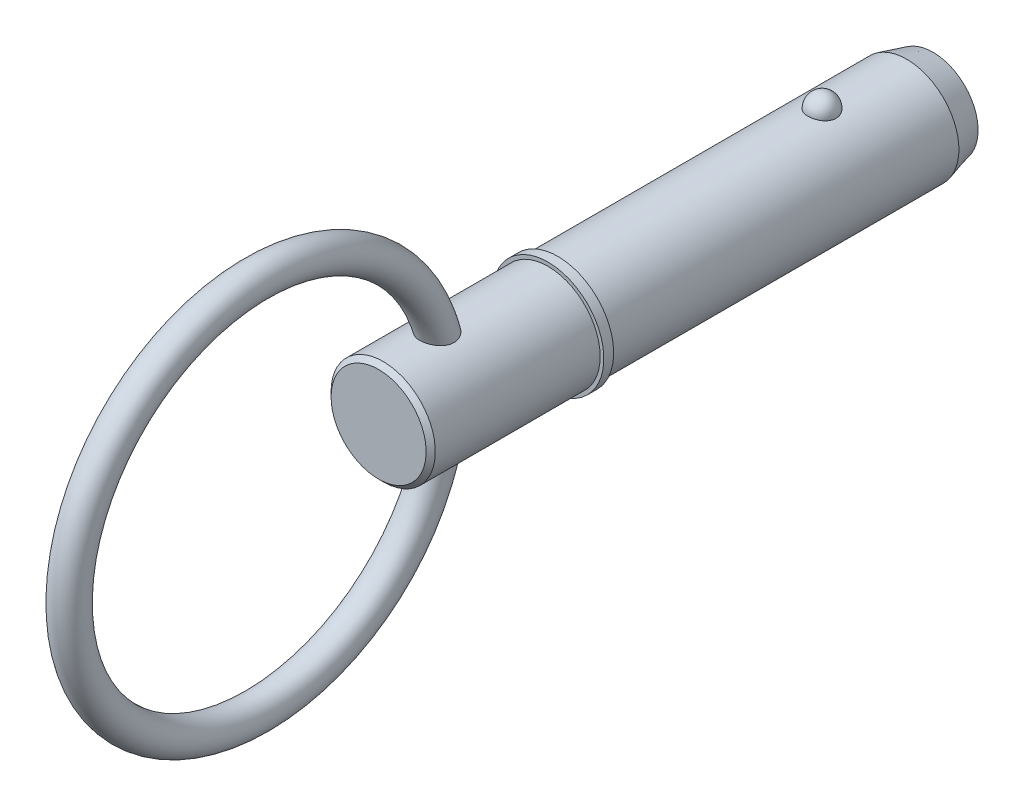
ISO-10303-21;
HEADER;
FILE_DESCRIPTION(('STEP AP214'),'2;1');
FILE_NAME('part.step','',(''),(''),'','','');
FILE_SCHEMA(('AUTOMOTIVE_DESIGN { 1 0 10303 214 1 1 1 1 }'));
ENDSEC;
DATA;
#1=APPLICATION_CONTEXT('core data for automotive mechanical design processes');
#2=APPLICATION_PROTOCOL_DEFINITION('international standard','automotive_design',2000,#1);
#3=PRODUCT_CONTEXT('',#1,'mechanical');
#4=PRODUCT('Part','Part','',(#3));
#5=PRODUCT_RELATED_PRODUCT_CATEGORY('part','',(#4));
#6=PRODUCT_DEFINITION_FORMATION('','',#4);
#7=PRODUCT_DEFINITION_CONTEXT('part definition',#1,'design');
#8=PRODUCT_DEFINITION('design','',#6,#7);
#9=PRODUCT_DEFINITION_SHAPE('','',#8);
#10=(LENGTH_UNIT() NAMED_UNIT(*) SI_UNIT(.MILLI.,.METRE.));
#11=(NAMED_UNIT(*) PLANE_ANGLE_UNIT() SI_UNIT($,.RADIAN.));
#12=(NAMED_UNIT(*) SI_UNIT($,.STERADIAN.) SOLID_ANGLE_UNIT());
#13=UNCERTAINTY_MEASURE_WITH_UNIT(LENGTH_MEASURE(1.E-05),#10,'distance_accuracy_value','');
#14=(GEOMETRIC_REPRESENTATION_CONTEXT(3) GLOBAL_UNCERTAINTY_ASSIGNED_CONTEXT((#13)) GLOBAL_UNIT_ASSIGNED_CONTEXT((#10,
#11,#12)) REPRESENTATION_CONTEXT('',''));
#15=CARTESIAN_POINT('',(0.,0.,0.));
#16=DIRECTION('',(0.,0.,1.));
#17=DIRECTION('',(1.,0.,0.));
#18=AXIS2_PLACEMENT_3D('',#15,#16,#17);
#19=CARTESIAN_POINT('',(0.,0.,38.1));
#20=DIRECTION('',(0.,0.,-1.));
#21=DIRECTION('',(-1.,0.,0.));
#22=AXIS2_PLACEMENT_3D('',#19,#20,#21);
#23=CYLINDRICAL_SURFACE('',#22,7.94);
#24=CARTESIAN_POINT('',(2.13020349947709,7.64891057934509,-2.15));
#25=CARTESIAN_POINT('',(2.1302012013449,7.64891247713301,-2.0297816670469));
#26=CARTESIAN_POINT('',(2.12037546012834,7.65166842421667,-1.90953383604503));
#27=CARTESIAN_POINT('',(2.08130792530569,7.66238579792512,-1.67243962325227));
#28=CARTESIAN_POINT('',(2.05205785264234,7.67034944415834,-1.55559471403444));
#29=CARTESIAN_POINT('',(1.97489181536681,7.69057749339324,-1.32869361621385));
#30=CARTESIAN_POINT('',(1.92698409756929,7.70283999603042,-1.21863445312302));
#31=CARTESIAN_POINT('',(1.81370645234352,7.73029430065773,-1.00831338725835));
#32=CARTESIAN_POINT('',(1.74833715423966,7.7454859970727,-0.908051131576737));
#33=CARTESIAN_POINT('',(1.60144242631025,7.77718699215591,-0.719628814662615));
#34=CARTESIAN_POINT('',(1.51984382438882,7.7937020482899,-0.631526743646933));
#35=CARTESIAN_POINT('',(1.34279837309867,7.82614685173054,-0.470411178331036));
#36=CARTESIAN_POINT('',(1.24735148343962,7.84207659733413,-0.397397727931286));
#37=CARTESIAN_POINT('',(1.04544839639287,7.87153116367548,-0.268681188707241));
#38=CARTESIAN_POINT('',(0.939022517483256,7.88506234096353,-0.212932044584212));
#39=CARTESIAN_POINT('',(0.717931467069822,7.90825597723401,-0.120080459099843));
#40=CARTESIAN_POINT('',(0.603267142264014,7.9179188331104,-0.0829761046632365));
#41=CARTESIAN_POINT('',(0.371015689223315,7.93216561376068,-0.0289596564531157));
#42=CARTESIAN_POINT('',(0.253510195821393,7.93683225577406,-0.0117183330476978));
#43=CARTESIAN_POINT('',(0.0171784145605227,7.94086051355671,0.00318921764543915));
#44=CARTESIAN_POINT('',(-0.101647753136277,7.94022260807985,0.000857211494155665));
#45=CARTESIAN_POINT('',(-0.335567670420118,7.93375751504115,-0.0231465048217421));
#46=CARTESIAN_POINT('',(-0.450690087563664,7.92799987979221,-0.0445590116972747));
#47=CARTESIAN_POINT('',(-0.675610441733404,7.91200792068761,-0.105760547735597));
#48=CARTESIAN_POINT('',(-0.785408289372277,7.90177352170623,-0.145549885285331));
#49=CARTESIAN_POINT('',(-0.997270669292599,7.87784802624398,-0.242675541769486));
#50=CARTESIAN_POINT('',(-1.0992893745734,7.86413823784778,-0.300107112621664));
#51=CARTESIAN_POINT('',(-1.29223659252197,7.83474718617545,-0.430887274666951));
#52=CARTESIAN_POINT('',(-1.38316404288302,7.81906573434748,-0.50423738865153));
#53=CARTESIAN_POINT('',(-1.55313516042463,7.78710451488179,-0.666358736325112));
#54=CARTESIAN_POINT('',(-1.63193689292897,7.77081906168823,-0.755382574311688));
#55=CARTESIAN_POINT('',(-1.77366356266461,7.73970270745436,-0.945507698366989));
#56=CARTESIAN_POINT('',(-1.83658745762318,7.72487190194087,-1.04660977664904));
#57=CARTESIAN_POINT('',(-1.94556640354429,7.6981535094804,-1.25927689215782));
#58=CARTESIAN_POINT('',(-1.99143480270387,7.6862989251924,-1.3709418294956));
#59=CARTESIAN_POINT('',(-2.06418311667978,7.66708387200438,-1.60066153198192));
#60=CARTESIAN_POINT('',(-2.0910635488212,7.65972328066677,-1.71871612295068));
#61=CARTESIAN_POINT('',(-2.12508507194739,7.65035479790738,-1.9573607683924));
#62=CARTESIAN_POINT('',(-2.13230490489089,7.64832555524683,-2.0779387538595));
#63=CARTESIAN_POINT('',(-2.12704767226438,7.64978921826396,-2.31862835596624));
#64=CARTESIAN_POINT('',(-2.1145710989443,7.6532819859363,-2.43873998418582));
#65=CARTESIAN_POINT('',(-2.07034166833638,7.66536368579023,-2.67451689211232));
#66=CARTESIAN_POINT('',(-2.03867758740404,7.67392914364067,-2.79020005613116));
#67=CARTESIAN_POINT('',(-1.95694065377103,7.69517736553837,-3.01446692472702));
#68=CARTESIAN_POINT('',(-1.90686710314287,7.70786028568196,-3.12305035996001));
#69=CARTESIAN_POINT('',(-1.78925555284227,7.73600831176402,-3.33065971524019));
#70=CARTESIAN_POINT('',(-1.72162904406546,7.75148739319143,-3.4296336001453));
#71=CARTESIAN_POINT('',(-1.57074739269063,7.78346215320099,-3.61466914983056));
#72=CARTESIAN_POINT('',(-1.48749169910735,7.79995786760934,-3.70073035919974));
#73=CARTESIAN_POINT('',(-1.30720250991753,7.83219119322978,-3.85783594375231));
#74=CARTESIAN_POINT('',(-1.2101234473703,7.84792605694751,-3.92882863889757));
#75=CARTESIAN_POINT('',(-1.00503150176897,7.87681523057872,-4.05342383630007));
#76=CARTESIAN_POINT('',(-0.897019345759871,7.88996971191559,-4.10702749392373));
#77=CARTESIAN_POINT('',(-0.674439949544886,7.91208451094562,-4.19477736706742));
#78=CARTESIAN_POINT('',(-0.559965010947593,7.92109245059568,-4.22914554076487));
#79=CARTESIAN_POINT('',(-0.326625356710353,7.93413878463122,-4.27838865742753));
#80=CARTESIAN_POINT('',(-0.207761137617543,7.93817773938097,-4.29326579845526));
#81=CARTESIAN_POINT('',(0.0287357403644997,7.94081322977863,-4.3030062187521));
#82=CARTESIAN_POINT('',(0.146353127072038,7.93950453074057,-4.29821797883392));
#83=CARTESIAN_POINT('',(0.379062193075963,7.93180098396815,-4.26955229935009));
#84=CARTESIAN_POINT('',(0.494153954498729,7.92540630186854,-4.24567548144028));
#85=CARTESIAN_POINT('',(0.718185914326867,7.90824874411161,-4.17962260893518));
#86=CARTESIAN_POINT('',(0.827145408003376,7.89750055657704,-4.13750805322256));
#87=CARTESIAN_POINT('',(1.03638036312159,7.87277755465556,-4.03615078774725));
#88=CARTESIAN_POINT('',(1.13665531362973,7.85880255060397,-3.97690707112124));
#89=CARTESIAN_POINT('',(1.32729731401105,7.82887859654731,-3.84189297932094));
#90=CARTESIAN_POINT('',(1.41749828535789,7.81290379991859,-3.76589388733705));
#91=CARTESIAN_POINT('',(1.58397257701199,7.78086330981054,-3.59992466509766));
#92=CARTESIAN_POINT('',(1.66024342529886,7.76479760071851,-3.50995206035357));
#93=CARTESIAN_POINT('',(1.79805631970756,7.73405928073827,-3.31688321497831));
#94=CARTESIAN_POINT('',(1.85933944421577,7.719413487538,-3.213597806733));
#95=CARTESIAN_POINT('',(1.96397499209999,7.69345992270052,-2.99796163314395));
#96=CARTESIAN_POINT('',(2.00733488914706,7.68215076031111,-2.88561466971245));
#97=CARTESIAN_POINT('',(2.07068045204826,7.66529896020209,-2.66994136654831));
#98=CARTESIAN_POINT('',(2.09296296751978,7.65919990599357,-2.56732606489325));
#99=CARTESIAN_POINT('',(2.12272535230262,7.65100492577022,-2.35981463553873));
#100=CARTESIAN_POINT('',(2.13020550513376,7.64890892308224,-2.25491855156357));
#101=CARTESIAN_POINT('',(2.13020349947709,7.64891057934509,-2.15));
#102=B_SPLINE_CURVE_WITH_KNOTS('',3,(#24,#25,#26,#27,#28,#29,#30,#31,#32,#33,#34,#35,#36,#37,
#38,#39,#40,#41,#42,#43,#44,#45,#46,#47,#48,#49,#50,#51,#52,#53,#54,#55,#56,#57,#58,#59,#60,#61,
#62,#63,#64,#65,#66,#67,#68,#69,#70,#71,#72,#73,#74,#75,#76,#77,#78,#79,#80,#81,#82,#83,#84,#85,
#86,#87,#88,#89,#90,#91,#92,#93,#94,#95,#96,#97,#98,#99,#100,#101),.UNSPECIFIED.,.T.,.F.,(4,2,2,
2,2,2,2,2,2,2,2,2,2,2,2,2,2,2,2,2,2,2,2,2,2,2,2,2,2,2,2,2,2,2,2,2,2,2,4),(0.,0.360277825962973,
0.720709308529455,1.0809816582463,1.44124102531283,1.80316307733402,2.16508618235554,
2.52603531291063,2.88694740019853,3.24178717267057,3.59659491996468,3.94665496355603,
4.2967208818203,4.64871108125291,5.00073496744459,5.35906196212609,5.71741247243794,
6.079576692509,6.44173104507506,6.80243279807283,7.16312553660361,7.52216203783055,
7.88121215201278,8.24210915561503,8.60301888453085,8.96514709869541,9.32725124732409,
9.68508606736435,10.0428805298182,10.3943622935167,10.7458326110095,11.0961268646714,
11.4464417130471,11.8018724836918,12.1573662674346,12.5186252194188,12.8797333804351,
13.1941658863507,13.5085923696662),.UNSPECIFIED.);
#103=CARTESIAN_POINT('',(2.13020349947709,7.64891057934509,-2.15));
#104=VERTEX_POINT('',#103);
#105=EDGE_CURVE('E101',#104,#104,#102,.T.);
#106=ORIENTED_EDGE('',*,*,#105,.T.);
#107=EDGE_LOOP('',(#106));
#108=FACE_BOUND('',#107,.T.);
#109=CARTESIAN_POINT('',(0.,0.,-15.05));
#110=DIRECTION('',(0.,0.,-1.));
#111=DIRECTION('',(-1.,0.,0.));
#112=AXIS2_PLACEMENT_3D('',#109,#110,#111);
#113=CIRCLE('',#112,7.94);
#114=CARTESIAN_POINT('',(-7.94,0.,-15.05));
#115=VERTEX_POINT('',#114);
#116=EDGE_CURVE('E109',#115,#115,#113,.F.);
#117=ORIENTED_EDGE('',*,*,#116,.T.);
#118=EDGE_LOOP('',(#117));
#119=FACE_BOUND('',#118,.T.);
#120=CARTESIAN_POINT('',(0.,0.,38.1));
#121=DIRECTION('',(0.,0.,1.));
#122=DIRECTION('',(1.,0.,0.));
#123=AXIS2_PLACEMENT_3D('',#120,#121,#122);
#124=CIRCLE('',#123,7.94);
#125=CARTESIAN_POINT('',(7.94,0.,38.1));
#126=VERTEX_POINT('',#125);
#127=EDGE_CURVE('E107',#126,#126,#124,.T.);
#128=ORIENTED_EDGE('',*,*,#127,.F.);
#129=EDGE_LOOP('',(#128));
#130=FACE_BOUND('',#129,.T.);
#131=ADVANCED_FACE('F39',(#108,#119,#130),#23,.T.);
#132=CARTESIAN_POINT('',(0.,0.,-19.05));
#133=DIRECTION('',(0.,0.,-1.));
#134=DIRECTION('',(-1.,0.,0.));
#135=AXIS2_PLACEMENT_3D('',#132,#133,#134);
#136=PLANE('',#135);
#137=CARTESIAN_POINT('',(0.,0.,-19.05));
#138=DIRECTION('',(0.,0.,-1.));
#139=DIRECTION('',(-1.,0.,0.));
#140=AXIS2_PLACEMENT_3D('',#137,#138,#139);
#141=CIRCLE('',#140,6.86820323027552);
#142=CARTESIAN_POINT('',(-6.86820323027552,0.,-19.05));
#143=VERTEX_POINT('',#142);
#144=EDGE_CURVE('E141',#143,#143,#141,.T.);
#145=ORIENTED_EDGE('',*,*,#144,.T.);
#146=EDGE_LOOP('',(#145));
#147=FACE_BOUND('',#146,.T.);
#148=ADVANCED_FACE('F87',(#147),#136,.T.);
#149=CARTESIAN_POINT('',(0.,0.,-19.05));
#150=DIRECTION('',(0.,0.,1.));
#151=DIRECTION('',(1.,0.,0.));
#152=AXIS2_PLACEMENT_3D('',#149,#150,#151);
#153=CONICAL_SURFACE('',#152,6.86820323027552,0.261799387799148);
#154=ORIENTED_EDGE('',*,*,#116,.F.);
#155=EDGE_LOOP('',(#154));
#156=FACE_BOUND('',#155,.T.);
#157=ORIENTED_EDGE('',*,*,#144,.F.);
#158=EDGE_LOOP('',(#157));
#159=FACE_BOUND('',#158,.T.);
#160=ADVANCED_FACE('F93',(#156,#159),#153,.T.);
#161=CARTESIAN_POINT('',(0.,7.94,-2.15));
#162=DIRECTION('',(0.,1.,0.));
#163=DIRECTION('',(0.,0.,1.));
#164=AXIS2_PLACEMENT_3D('',#161,#162,#163);
#165=SPHERICAL_SURFACE('',#164,2.15);
#166=ORIENTED_EDGE('',*,*,#105,.F.);
#167=EDGE_LOOP('',(#166));
#168=FACE_BOUND('',#167,.T.);
#169=ADVANCED_FACE('F112',(#168),#165,.T.);
#170=CARTESIAN_POINT('',(0.,0.,38.1));
#171=DIRECTION('',(0.,0.,-1.));
#172=DIRECTION('',(-1.,0.,0.));
#173=AXIS2_PLACEMENT_3D('',#170,#171,#172);
#174=PLANE('',#173);
#175=ORIENTED_EDGE('',*,*,#127,.T.);
#176=EDGE_LOOP('',(#175));
#177=FACE_BOUND('',#176,.T.);
#178=CARTESIAN_POINT('',(0.,0.,38.1));
#179=DIRECTION('',(0.,0.,-1.));
#180=DIRECTION('',(-1.,0.,0.));
#181=AXIS2_PLACEMENT_3D('',#178,#179,#180);
#182=CIRCLE('',#181,8.5);
#183=CARTESIAN_POINT('',(-8.5,0.,38.1));
#184=VERTEX_POINT('',#183);
#185=EDGE_CURVE('E108',#184,#184,#182,.T.);
#186=ORIENTED_EDGE('',*,*,#185,.T.);
#187=EDGE_LOOP('',(#186));
#188=FACE_BOUND('',#187,.T.);
#189=ADVANCED_FACE('F116',(#177,#188),#174,.T.);
#190=CARTESIAN_POINT('',(0.,0.,33.7287874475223));
#191=DIRECTION('',(0.,0.,-1.));
#192=DIRECTION('',(-1.,0.,0.));
#193=AXIS2_PLACEMENT_3D('',#190,#191,#192);
#194=CYLINDRICAL_SURFACE('',#193,8.5);
#195=CARTESIAN_POINT('',(0.,0.,39.6));
#196=DIRECTION('',(0.,0.,-1.));
#197=DIRECTION('',(-1.,0.,0.));
#198=AXIS2_PLACEMENT_3D('',#195,#196,#197);
#199=CIRCLE('',#198,8.5);
#200=CARTESIAN_POINT('',(-8.5,0.,39.6));
#201=VERTEX_POINT('',#200);
#202=EDGE_CURVE('E133',#201,#201,#199,.T.);
#203=ORIENTED_EDGE('',*,*,#202,.T.);
#204=EDGE_LOOP('',(#203));
#205=FACE_BOUND('',#204,.T.);
#206=ORIENTED_EDGE('',*,*,#185,.F.);
#207=EDGE_LOOP('',(#206));
#208=FACE_BOUND('',#207,.T.);
#209=ADVANCED_FACE('F120',(#205,#208),#194,.T.);
#210=CARTESIAN_POINT('',(0.,8.5,39.6));
#211=DIRECTION('',(0.,0.,1.));
#212=DIRECTION('',(1.,0.,0.));
#213=AXIS2_PLACEMENT_3D('',#210,#211,#212);
#214=PLANE('',#213);
#215=CARTESIAN_POINT('',(0.,0.,39.6));
#216=DIRECTION('',(0.,0.,1.));
#217=DIRECTION('',(1.,0.,0.));
#218=AXIS2_PLACEMENT_3D('',#215,#216,#217);
#219=CIRCLE('',#218,7.94);
#220=CARTESIAN_POINT('',(7.94,0.,39.6));
#221=VERTEX_POINT('',#220);
#222=EDGE_CURVE('E111',#221,#221,#219,.T.);
#223=ORIENTED_EDGE('',*,*,#222,.F.);
#224=EDGE_LOOP('',(#223));
#225=FACE_BOUND('',#224,.T.);
#226=ORIENTED_EDGE('',*,*,#202,.F.);
#227=EDGE_LOOP('',(#226));
#228=FACE_BOUND('',#227,.T.);
#229=ADVANCED_FACE('F84',(#225,#228),#214,.T.);
#230=CARTESIAN_POINT('',(0.,0.,65.41));
#231=DIRECTION('',(0.,0.,-1.));
#232=DIRECTION('',(-1.,0.,0.));
#233=AXIS2_PLACEMENT_3D('',#230,#231,#232);
#234=CYLINDRICAL_SURFACE('',#233,7.94);
#235=CARTESIAN_POINT('',(-1.15544091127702,-7.85547938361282,54.211910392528));
#236=CARTESIAN_POINT('',(-1.03089695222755,-7.87379554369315,54.1496153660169));
#237=CARTESIAN_POINT('',(-0.900845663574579,-7.8898743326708,54.0975936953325));
#238=CARTESIAN_POINT('',(-0.633417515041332,-7.91583465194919,54.015265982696));
#239=CARTESIAN_POINT('',(-0.49603783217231,-7.92571377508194,53.9849683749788));
#240=CARTESIAN_POINT('',(-0.217881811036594,-7.93823020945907,53.9467734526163));
#241=CARTESIAN_POINT('',(-0.0771057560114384,-7.94086812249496,53.9388742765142));
#242=CARTESIAN_POINT('',(0.20382834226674,-7.93862624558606,53.9456489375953));
#243=CARTESIAN_POINT('',(0.343986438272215,-7.93374711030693,53.9603208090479));
#244=CARTESIAN_POINT('',(0.61954486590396,-7.9169944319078,54.0118776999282));
#245=CARTESIAN_POINT('',(0.754950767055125,-7.9051293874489,54.048735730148));
#246=CARTESIAN_POINT('',(1.01737529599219,-7.8756583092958,54.1438425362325));
#247=CARTESIAN_POINT('',(1.14439334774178,-7.85805188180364,54.2020927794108));
#248=CARTESIAN_POINT('',(1.38668443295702,-7.81893907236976,54.3388428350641));
#249=CARTESIAN_POINT('',(1.50193494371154,-7.79742542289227,54.4173804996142));
#250=CARTESIAN_POINT('',(1.71711272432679,-7.75288428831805,54.5928724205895));
#251=CARTESIAN_POINT('',(1.81704089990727,-7.72985689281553,54.6898255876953));
#252=CARTESIAN_POINT('',(1.99787261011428,-7.68509802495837,54.8988714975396));
#253=CARTESIAN_POINT('',(2.07893183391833,-7.66335713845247,55.0108273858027));
#254=CARTESIAN_POINT('',(2.22076589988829,-7.62346723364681,55.2474809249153));
#255=CARTESIAN_POINT('',(2.28154607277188,-7.6053172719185,55.3721752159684));
#256=CARTESIAN_POINT('',(2.38011540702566,-7.57504217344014,55.6276189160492));
#257=CARTESIAN_POINT('',(2.41840843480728,-7.56278621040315,55.7581588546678));
#258=CARTESIAN_POINT('',(2.47363993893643,-7.54490265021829,56.0240951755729));
#259=CARTESIAN_POINT('',(2.49057788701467,-7.53927521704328,56.1594916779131));
#260=CARTESIAN_POINT('',(2.50351014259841,-7.53499042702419,56.4324287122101));
#261=CARTESIAN_POINT('',(2.49933630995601,-7.53638902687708,56.5699777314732));
#262=CARTESIAN_POINT('',(2.47072547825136,-7.54581524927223,56.8426982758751));
#263=CARTESIAN_POINT('',(2.44628184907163,-7.55384504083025,56.9778690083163));
#264=CARTESIAN_POINT('',(2.3758931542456,-7.57629160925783,57.2530857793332));
#265=CARTESIAN_POINT('',(2.32844094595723,-7.5911515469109,57.3927089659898));
#266=CARTESIAN_POINT('',(2.21332780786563,-7.62550828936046,57.6627818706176));
#267=CARTESIAN_POINT('',(2.14565489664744,-7.64500784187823,57.7932260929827));
#268=CARTESIAN_POINT('',(1.98438755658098,-7.68852412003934,58.0537020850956));
#269=CARTESIAN_POINT('',(1.88896913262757,-7.71279219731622,58.1825698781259));
#270=CARTESIAN_POINT('',(1.67743245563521,-7.76154719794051,58.422112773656));
#271=CARTESIAN_POINT('',(1.56130644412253,-7.78603420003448,58.5327810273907));
#272=CARTESIAN_POINT('',(1.31168281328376,-7.83191501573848,58.7301000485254));
#273=CARTESIAN_POINT('',(1.17841631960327,-7.85334315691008,58.8170293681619));
#274=CARTESIAN_POINT('',(0.967442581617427,-7.88116219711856,58.9266577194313));
#275=CARTESIAN_POINT('',(0.8952834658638,-7.88971376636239,58.9597363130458));
#276=CARTESIAN_POINT('',(0.747777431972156,-7.90505596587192,59.0184005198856));
#277=CARTESIAN_POINT('',(0.672431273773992,-7.91184701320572,59.0439879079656));
#278=CARTESIAN_POINT('',(0.530575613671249,-7.92252382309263,59.0839121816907));
#279=CARTESIAN_POINT('',(0.464394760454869,-7.92668987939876,59.099349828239));
#280=CARTESIAN_POINT('',(0.330815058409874,-7.9333870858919,59.1240698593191));
#281=CARTESIAN_POINT('',(0.263416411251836,-7.93591850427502,59.1333532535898));
#282=CARTESIAN_POINT('',(0.128041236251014,-7.93925585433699,59.1455779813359));
#283=CARTESIAN_POINT('',(0.0600650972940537,-7.94006286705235,59.1485232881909));
#284=CARTESIAN_POINT('',(-0.0758408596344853,-7.93992929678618,59.1480336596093));
#285=CARTESIAN_POINT('',(-0.143770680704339,-7.93898884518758,59.1445992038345));
#286=CARTESIAN_POINT('',(-0.330023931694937,-7.93402174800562,59.1264060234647));
#287=CARTESIAN_POINT('',(-0.447720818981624,-7.92820264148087,59.1050608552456));
#288=CARTESIAN_POINT('',(-0.677833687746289,-7.91185818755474,59.0440930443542));
#289=CARTESIAN_POINT('',(-0.790248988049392,-7.90133223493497,59.0044680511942));
#290=CARTESIAN_POINT('',(-1.01082100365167,-7.8762011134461,58.9074365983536));
#291=CARTESIAN_POINT('',(-1.11873674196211,-7.86147932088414,58.849515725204));
#292=CARTESIAN_POINT('',(-1.32464461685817,-7.8294189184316,58.7187556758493));
#293=CARTESIAN_POINT('',(-1.42263264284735,-7.81207923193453,58.6459103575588));
#294=CARTESIAN_POINT('',(-1.62038324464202,-7.77363945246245,58.4765366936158));
#295=CARTESIAN_POINT('',(-1.71849387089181,-7.75235190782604,58.3781231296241));
#296=CARTESIAN_POINT('',(-1.89908721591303,-7.71010284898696,58.1677830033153));
#297=CARTESIAN_POINT('',(-1.98155871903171,-7.68914157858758,58.0558468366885));
#298=CARTESIAN_POINT('',(-2.13974270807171,-7.64674394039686,57.8051085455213));
#299=CARTESIAN_POINT('',(-2.2130402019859,-7.62562536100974,57.6647194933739));
#300=CARTESIAN_POINT('',(-2.33615659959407,-7.58881542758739,57.3732666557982));
#301=CARTESIAN_POINT('',(-2.38596943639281,-7.57312547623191,57.2222001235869));
#302=CARTESIAN_POINT('',(-2.46059473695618,-7.54921618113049,56.9104922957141));
#303=CARTESIAN_POINT('',(-2.48494918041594,-7.54113395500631,56.7497288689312));
#304=CARTESIAN_POINT('',(-2.50480773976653,-7.53456588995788,56.4262447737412));
#305=CARTESIAN_POINT('',(-2.50033692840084,-7.53607171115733,56.2635259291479));
#306=CARTESIAN_POINT('',(-2.46306926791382,-7.54832452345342,55.9571659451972));
#307=CARTESIAN_POINT('',(-2.4329569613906,-7.55819528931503,55.8131623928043));
#308=CARTESIAN_POINT('',(-2.34806892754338,-7.58499431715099,55.5333040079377));
#309=CARTESIAN_POINT('',(-2.29330013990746,-7.60192059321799,55.3974468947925));
#310=CARTESIAN_POINT('',(-2.16523724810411,-7.63933506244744,55.1476573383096));
#311=CARTESIAN_POINT('',(-2.09353456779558,-7.65948502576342,55.0328530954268));
#312=CARTESIAN_POINT('',(-1.93200913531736,-7.7018104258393,54.8172680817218));
#313=CARTESIAN_POINT('',(-1.842192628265,-7.72398516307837,54.7164824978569));
#314=CARTESIAN_POINT('',(-1.65746337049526,-7.76558957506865,54.5413148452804));
#315=CARTESIAN_POINT('',(-1.56413624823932,-7.78505810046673,54.4652591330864));
#316=CARTESIAN_POINT('',(-1.36706423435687,-7.82207051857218,54.3275357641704));
#317=CARTESIAN_POINT('',(-1.26331856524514,-7.83961426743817,54.2658691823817));
#318=CARTESIAN_POINT('',(-1.15544091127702,-7.85547938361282,54.211910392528));
#319=B_SPLINE_CURVE_WITH_KNOTS('',3,(#235,#236,#237,#238,#239,#240,#241,#242,#243,#244,#245,
#246,#247,#248,#249,#250,#251,#252,#253,#254,#255,#256,#257,#258,#259,#260,#261,#262,#263,#264,
#265,#266,#267,#268,#269,#270,#271,#272,#273,#274,#275,#276,#277,#278,#279,#280,#281,#282,#283,
#284,#285,#286,#287,#288,#289,#290,#291,#292,#293,#294,#295,#296,#297,#298,#299,#300,#301,#302,
#303,#304,#305,#306,#307,#308,#309,#310,#311,#312,#313,#314,#315,#316,#317,#318),.UNSPECIFIED.,
.T.,.F.,(4,2,2,2,2,2,2,2,2,2,2,2,2,2,2,2,2,2,2,2,2,2,2,2,2,2,2,2,2,2,2,2,2,2,2,2,2,2,2,2,2,4),
(0.,0.420927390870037,0.84201811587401,1.26307384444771,1.68409290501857,2.10460083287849,
2.52513760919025,2.94646475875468,3.36776699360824,3.78545897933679,4.20304108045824,
4.61086922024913,5.0187074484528,5.42979890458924,5.84102487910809,6.2838331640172,
6.72690434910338,7.21113455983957,7.69554657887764,8.1740030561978,8.41316278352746,
8.65226580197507,8.85622998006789,9.0601606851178,9.2639635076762,9.46775100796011,
9.82521046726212,10.1827159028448,10.5513335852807,10.9201032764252,11.3402098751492,
11.7606166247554,12.2377707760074,12.715048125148,13.2007716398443,13.6860727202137,
14.1260485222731,14.5659005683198,14.9745225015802,15.3830037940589,15.7475760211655,
16.1121754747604),.UNSPECIFIED.);
#320=CARTESIAN_POINT('',(-1.15544091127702,-7.85547938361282,54.211910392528));
#321=VERTEX_POINT('',#320);
#322=EDGE_CURVE('E10',#321,#321,#319,.T.);
#323=ORIENTED_EDGE('',*,*,#322,.F.);
#324=EDGE_LOOP('',(#323));
#325=FACE_BOUND('',#324,.T.);
#326=CARTESIAN_POINT('',(-1.15544091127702,7.85547938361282,54.211910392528));
#327=CARTESIAN_POINT('',(-1.278579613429,7.83736699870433,54.2735072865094));
#328=CARTESIAN_POINT('',(-1.39638360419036,7.8170599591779,54.3451720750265));
#329=CARTESIAN_POINT('',(-1.61803025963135,7.77421032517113,54.5070825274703));
#330=CARTESIAN_POINT('',(-1.72186951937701,7.75166718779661,54.5973327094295));
#331=CARTESIAN_POINT('',(-1.91269683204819,7.70680387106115,54.7943958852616));
#332=CARTESIAN_POINT('',(-1.99967065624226,7.68448389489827,54.9012227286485));
#333=CARTESIAN_POINT('',(-2.15412555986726,7.64262858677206,55.1286078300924));
#334=CARTESIAN_POINT('',(-2.2216118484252,7.62309251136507,55.2491624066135));
#335=CARTESIAN_POINT('',(-2.3342927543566,7.5893410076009,55.498377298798));
#336=CARTESIAN_POINT('',(-2.37985628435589,7.57503857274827,55.6268591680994));
#337=CARTESIAN_POINT('',(-2.44955571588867,7.55278941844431,55.890011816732));
#338=CARTESIAN_POINT('',(-2.47369226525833,7.544842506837,56.0246824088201));
#339=CARTESIAN_POINT('',(-2.50059611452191,7.53596831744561,56.2961377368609));
#340=CARTESIAN_POINT('',(-2.50339277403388,7.53503139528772,56.4329193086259));
#341=CARTESIAN_POINT('',(-2.48855779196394,7.53994222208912,56.7052240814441));
#342=CARTESIAN_POINT('',(-2.47092012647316,7.54579197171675,56.8407468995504));
#343=CARTESIAN_POINT('',(-2.41469361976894,7.56397908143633,57.1162931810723));
#344=CARTESIAN_POINT('',(-2.37479606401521,7.57671999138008,57.2560213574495));
#345=CARTESIAN_POINT('',(-2.27489955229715,7.60730881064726,57.5275158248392));
#346=CARTESIAN_POINT('',(-2.21489004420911,7.6251594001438,57.6592778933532));
#347=CARTESIAN_POINT('',(-2.06943931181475,7.66598084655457,57.9245250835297));
#348=CARTESIAN_POINT('',(-1.98208275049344,7.68928197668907,58.0569147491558));
#349=CARTESIAN_POINT('',(-1.78658869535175,7.73704343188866,58.3052357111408));
#350=CARTESIAN_POINT('',(-1.67843905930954,7.76150442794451,58.421157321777));
#351=CARTESIAN_POINT('',(-1.44142605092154,7.80900750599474,58.6336999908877));
#352=CARTESIAN_POINT('',(-1.31231821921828,7.83202775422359,58.7300586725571));
#353=CARTESIAN_POINT('',(-1.10627655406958,7.86286215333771,58.8546145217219));
#354=CARTESIAN_POINT('',(-1.035525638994,7.87252500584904,58.8928053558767));
#355=CARTESIAN_POINT('',(-0.890375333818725,7.89025728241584,58.9618851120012));
#356=CARTESIAN_POINT('',(-0.815978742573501,7.89832790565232,58.9927795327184));
#357=CARTESIAN_POINT('',(-0.674180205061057,7.91160332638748,59.0430828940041));
#358=CARTESIAN_POINT('',(-0.607145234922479,7.91704543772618,59.063468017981));
#359=CARTESIAN_POINT('',(-0.471385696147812,7.92628663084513,59.0978763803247));
#360=CARTESIAN_POINT('',(-0.402662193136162,7.93008672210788,59.1119035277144));
#361=CARTESIAN_POINT('',(-0.264153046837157,7.9359070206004,59.133322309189));
#362=CARTESIAN_POINT('',(-0.194368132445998,7.9379283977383,59.1407183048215));
#363=CARTESIAN_POINT('',(-0.0544054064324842,7.940122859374,59.1487430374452));
#364=CARTESIAN_POINT('',(0.0157723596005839,7.94029615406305,59.1493725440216));
#365=CARTESIAN_POINT('',(0.20629582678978,7.93822912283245,59.1418250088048));
#366=CARTESIAN_POINT('',(0.326425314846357,7.93416340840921,59.1269891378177));
#367=CARTESIAN_POINT('',(0.562310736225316,7.92094769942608,59.0780777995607));
#368=CARTESIAN_POINT('',(0.678066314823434,7.91179729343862,59.04400077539));
#369=CARTESIAN_POINT('',(0.903029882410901,7.88929555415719,58.9582699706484));
#370=CARTESIAN_POINT('',(1.01220356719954,7.87592415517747,58.9065321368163));
#371=CARTESIAN_POINT('',(1.22142047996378,7.84620431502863,58.7877939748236));
#372=CARTESIAN_POINT('',(1.32146048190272,7.82985482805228,58.7207882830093));
#373=CARTESIAN_POINT('',(1.52328754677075,7.7932678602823,58.5643092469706));
#374=CARTESIAN_POINT('',(1.6236508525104,7.77280069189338,58.4730560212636));
#375=CARTESIAN_POINT('',(1.80985117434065,7.73156849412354,58.2768153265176));
#376=CARTESIAN_POINT('',(1.895678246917,7.71080327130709,58.1718185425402));
#377=CARTESIAN_POINT('',(2.06302404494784,7.66785771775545,57.9345434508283));
#378=CARTESIAN_POINT('',(2.14213178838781,7.64590590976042,57.8005149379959));
#379=CARTESIAN_POINT('',(2.27825755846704,7.60645646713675,57.5209949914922));
#380=CARTESIAN_POINT('',(2.33526577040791,7.58896081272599,57.3754984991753));
#381=CARTESIAN_POINT('',(2.42707573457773,7.56011538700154,57.0702423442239));
#382=CARTESIAN_POINT('',(2.4608459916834,7.54905411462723,56.9101404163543));
#383=CARTESIAN_POINT('',(2.49980168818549,7.53624914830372,56.5861292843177));
#384=CARTESIAN_POINT('',(2.50500938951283,7.5344981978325,56.4222231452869));
#385=CARTESIAN_POINT('',(2.48594104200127,7.54080673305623,56.1099762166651));
#386=CARTESIAN_POINT('',(2.46407777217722,7.54806351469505,55.9614732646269));
#387=CARTESIAN_POINT('',(2.3945479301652,7.57040718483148,55.671258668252));
#388=CARTESIAN_POINT('',(2.34689355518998,7.58549037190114,55.5295438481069));
#389=CARTESIAN_POINT('',(2.2318274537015,7.62009243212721,55.2691410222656));
#390=CARTESIAN_POINT('',(2.16637710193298,7.63914093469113,55.1495179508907));
#391=CARTESIAN_POINT('',(2.01638736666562,7.68009146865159,54.9234609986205));
#392=CARTESIAN_POINT('',(1.93184850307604,7.7019934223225,54.8170267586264));
#393=CARTESIAN_POINT('',(1.746642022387,7.74608439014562,54.6206697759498));
#394=CARTESIAN_POINT('',(1.646079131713,7.76827073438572,54.5306474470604));
#395=CARTESIAN_POINT('',(1.43119791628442,7.81071401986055,54.3683086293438));
#396=CARTESIAN_POINT('',(1.31687846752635,7.83097080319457,54.2959935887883));
#397=CARTESIAN_POINT('',(1.07477437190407,7.86789551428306,54.169149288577));
#398=CARTESIAN_POINT('',(0.946739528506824,7.88446964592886,54.1150698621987));
#399=CARTESIAN_POINT('',(0.683029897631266,7.91167708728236,54.0282136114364));
#400=CARTESIAN_POINT('',(0.547354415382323,7.92230985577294,53.9954387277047));
#401=CARTESIAN_POINT('',(0.271066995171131,7.93658630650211,53.9517309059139));
#402=CARTESIAN_POINT('',(0.130424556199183,7.94017418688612,53.9409723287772));
#403=CARTESIAN_POINT('',(-0.150736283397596,7.93981282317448,53.9420624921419));
#404=CARTESIAN_POINT('',(-0.291254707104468,7.93586558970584,53.953905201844));
#405=CARTESIAN_POINT('',(-0.556023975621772,7.92151946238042,53.9978917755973));
#406=CARTESIAN_POINT('',(-0.680621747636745,7.91171585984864,54.0281668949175));
#407=CARTESIAN_POINT('',(-0.923476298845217,7.88705844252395,54.1067364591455));
#408=CARTESIAN_POINT('',(-1.04173303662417,7.87220459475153,54.1550310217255));
#409=CARTESIAN_POINT('',(-1.15544091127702,7.85547938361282,54.211910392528));
#410=B_SPLINE_CURVE_WITH_KNOTS('',3,(#326,#327,#328,#329,#330,#331,#332,#333,#334,#335,#336,
#337,#338,#339,#340,#341,#342,#343,#344,#345,#346,#347,#348,#349,#350,#351,#352,#353,#354,#355,
#356,#357,#358,#359,#360,#361,#362,#363,#364,#365,#366,#367,#368,#369,#370,#371,#372,#373,#374,
#375,#376,#377,#378,#379,#380,#381,#382,#383,#384,#385,#386,#387,#388,#389,#390,#391,#392,#393,
#394,#395,#396,#397,#398,#399,#400,#401,#402,#403,#404,#405,#406,#407,#408,#409),.UNSPECIFIED.,
.T.,.F.,(4,2,2,2,2,2,2,2,2,2,2,2,2,2,2,2,2,2,2,2,2,2,2,2,2,2,2,2,2,2,2,2,2,2,2,2,2,2,2,2,2,4),
(0.,0.416167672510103,0.832436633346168,1.24905527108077,1.66556244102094,2.0747916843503,
2.48400855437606,2.89266231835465,3.30143658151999,3.73725068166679,4.17329379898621,
4.65204873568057,5.13108409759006,5.61617224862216,5.85876072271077,6.10116578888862,
6.31168904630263,6.52208269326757,6.7323378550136,6.94256910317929,7.30398888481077,
7.66543791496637,8.02863174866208,8.39195337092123,8.80190673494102,9.21213940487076,
9.68159903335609,10.1512669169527,10.6406305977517,11.1296128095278,11.5779838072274,
12.0261429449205,12.4372146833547,12.8482752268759,13.256751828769,13.6652618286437,
14.0832160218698,14.5012082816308,14.9224982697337,15.3436758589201,15.72796797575,
16.1122626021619),.UNSPECIFIED.);
#411=CARTESIAN_POINT('',(-1.15544091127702,7.85547938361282,54.211910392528));
#412=VERTEX_POINT('',#411);
#413=EDGE_CURVE('E51',#412,#412,#410,.T.);
#414=ORIENTED_EDGE('',*,*,#413,.F.);
#415=EDGE_LOOP('',(#414));
#416=FACE_BOUND('',#415,.T.);
#417=CARTESIAN_POINT('',(0.,0.,64.71));
#418=DIRECTION('',(0.,0.,-1.));
#419=DIRECTION('',(-1.,0.,0.));
#420=AXIS2_PLACEMENT_3D('',#417,#418,#419);
#421=CIRCLE('',#420,7.94);
#422=CARTESIAN_POINT('',(-7.94,0.,64.71));
#423=VERTEX_POINT('',#422);
#424=EDGE_CURVE('E63',#423,#423,#421,.T.);
#425=ORIENTED_EDGE('',*,*,#424,.T.);
#426=EDGE_LOOP('',(#425));
#427=FACE_BOUND('',#426,.T.);
#428=ORIENTED_EDGE('',*,*,#222,.T.);
#429=EDGE_LOOP('',(#428));
#430=FACE_BOUND('',#429,.T.);
#431=ADVANCED_FACE('F68',(#325,#416,#427,#430),#234,.T.);
#432=CARTESIAN_POINT('',(0.,0.,65.41));
#433=DIRECTION('',(0.,0.,-1.));
#434=DIRECTION('',(-1.,0.,0.));
#435=AXIS2_PLACEMENT_3D('',#432,#433,#434);
#436=PLANE('',#435);
#437=CARTESIAN_POINT('',(0.,0.,65.41));
#438=DIRECTION('',(0.,0.,-1.));
#439=DIRECTION('',(-1.,0.,0.));
#440=AXIS2_PLACEMENT_3D('',#437,#438,#439);
#441=CIRCLE('',#440,7.24000000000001);
#442=CARTESIAN_POINT('',(-7.24000000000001,0.,65.41));
#443=VERTEX_POINT('',#442);
#444=EDGE_CURVE('E58',#443,#443,#441,.F.);
#445=ORIENTED_EDGE('',*,*,#444,.T.);
#446=EDGE_LOOP('',(#445));
#447=FACE_BOUND('',#446,.T.);
#448=ADVANCED_FACE('F75',(#447),#436,.F.);
#449=CARTESIAN_POINT('',(0.,0.,64.71));
#450=DIRECTION('',(0.,0.,-1.));
#451=DIRECTION('',(-1.,0.,0.));
#452=AXIS2_PLACEMENT_3D('',#449,#450,#451);
#453=CONICAL_SURFACE('',#452,7.94,0.785398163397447);
#454=ORIENTED_EDGE('',*,*,#444,.F.);
#455=EDGE_LOOP('',(#454));
#456=FACE_BOUND('',#455,.T.);
#457=ORIENTED_EDGE('',*,*,#424,.F.);
#458=EDGE_LOOP('',(#457));
#459=FACE_BOUND('',#458,.T.);
#460=ADVANCED_FACE('F41',(#456,#459),#453,.T.);
#461=CARTESIAN_POINT('',(0.,0.,83.985));
#462=DIRECTION('',(1.,0.,0.));
#463=DIRECTION('',(0.,0.,-1.));
#464=AXIS2_PLACEMENT_3D('',#461,#462,#463);
#465=TOROIDAL_SURFACE('',#464,28.575,2.5);
#466=ORIENTED_EDGE('',*,*,#322,.T.);
#467=EDGE_LOOP('',(#466));
#468=FACE_BOUND('',#467,.T.);
#469=ORIENTED_EDGE('',*,*,#413,.T.);
#470=EDGE_LOOP('',(#469));
#471=FACE_BOUND('',#470,.T.);
#472=ADVANCED_FACE('F72',(#468,#471),#465,.T.);
#473=CLOSED_SHELL('',(#131,#148,#160,#169,#189,#209,#229,#431,#448,#460,#472));
#474=MANIFOLD_SOLID_BREP('B2',#473);
#475=ADVANCED_BREP_SHAPE_REPRESENTATION('',(#18,#474),#14);
#476=SHAPE_DEFINITION_REPRESENTATION(#9,#475);
ENDSEC;
END-ISO-10303-21;
